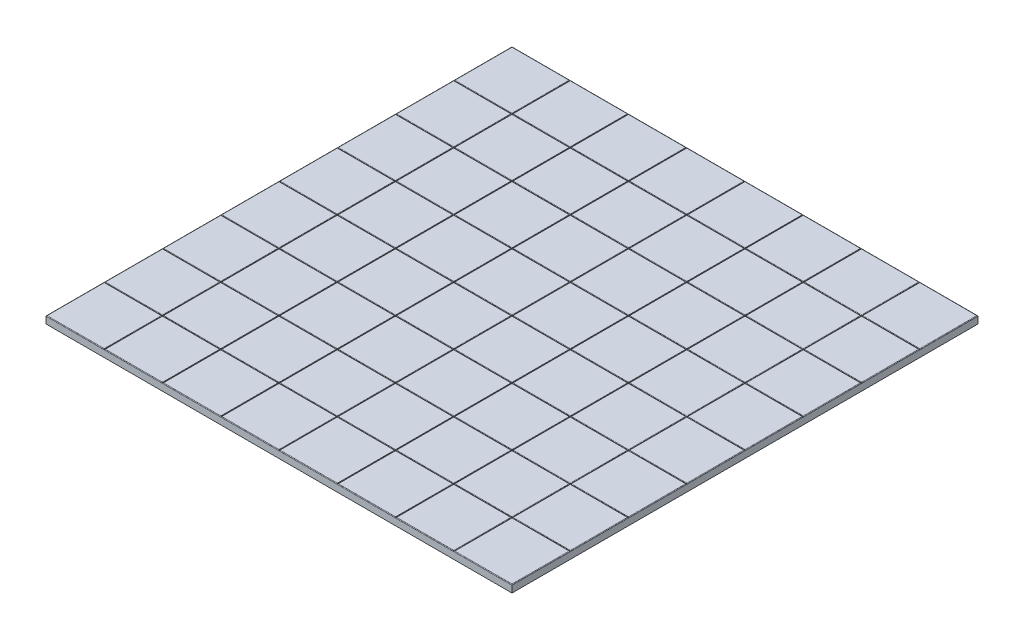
from build123d import *

# Parameters (mm, degrees)
SKETCH2_W           = 1600
SKETCH2_H           = 1600
BOSS_EXTRUDE1_DEPTH = 25
CUT_EXTRUDE1_DEPTH  = 1800
CUT_EXTRUDE5_DEPTH  = 1800
CUT_EXTRUDE6_DEPTH  = 1800
CUT_EXTRUDE9_DEPTH  = 1800
CUT_EXTRUDE10_DEPTH = 1800
CUT_EXTRUDE11_DEPTH = 1800
CUT_EXTRUDE12_DEPTH = 1800
CUT_EXTRUDE13_DEPTH = 1800


with BuildPart() as part:
    # Sketch2 → Boss-Extrude1 (new body)
    with BuildSketch(Plane(origin=(0, 0, 0), x_dir=(1, 0, 0), z_dir=(0, 1, 0))):
        with Locations((-366.131622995, 171.605086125)):
            Rectangle(SKETCH2_W, SKETCH2_H)
    extrude(amount=-BOSS_EXTRUDE1_DEPTH)

    # Sketch4 → Cut-Extrude1 (cut)
    with BuildSketch(Plane.XY.offset(750)):
        with BuildLine():
            Line((-1164.131622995, 0), (-1166.131622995, 0))
            Line((-1166.131622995, 0), (-1166.131622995, -2))
            ThreePointArc((-1166.131622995, -2), (-1165.545836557, -0.585786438), (-1164.131622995, 0))
        make_face()
    extrude(amount=-CUT_EXTRUDE1_DEPTH, mode=Mode.SUBTRACT)

    # Sketch5 → Cut-Extrude5 (cut)
    with BuildSketch(Plane.XY.offset(750)):
        with BuildLine():
            ThreePointArc((-966.24425762, -1.995387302), (-966.830044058, -0.58117374), (-968.24425762, 0.004612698))
            Line((-968.24425762, 0.004612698), (-964.24425762, 0.004612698))
            ThreePointArc((-964.24425762, 0.004612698), (-965.658471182, -0.58117374), (-966.24425762, -1.995387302))
        make_face()
        with BuildLine():
            ThreePointArc((-766.210661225, -1.966529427), (-766.796447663, -0.552315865), (-768.210661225, 0.033470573))
            Line((-768.210661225, 0.033470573), (-764.210661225, 0.033470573))
            ThreePointArc((-764.210661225, 0.033470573), (-765.624874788, -0.552315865), (-766.210661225, -1.966529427))
        make_face()
        with BuildLine():
            ThreePointArc((-566.094374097, -1.975317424), (-566.680160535, -0.561103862), (-568.094374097, 0.024682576))
            Line((-568.094374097, 0.024682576), (-564.094374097, 0.024682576))
            ThreePointArc((-564.094374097, 0.024682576), (-565.50858766, -0.561103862), (-566.094374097, -1.975317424))
        make_face()
        with BuildLine():
            ThreePointArc((-366.172549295, -1.993040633), (-366.758335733, -0.57882707), (-368.172549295, 0.006959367))
            Line((-368.172549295, 0.006959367), (-364.172549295, 0.006959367))
            ThreePointArc((-364.172549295, 0.006959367), (-365.586762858, -0.57882707), (-366.172549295, -1.993040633))
        make_face()
        with BuildLine():
            ThreePointArc((-165.984228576, -1.948557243), (-166.570015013, -0.53434368), (-167.984228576, 0.051442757))
            Line((-167.984228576, 0.051442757), (-163.984228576, 0.051442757))
            ThreePointArc((-163.984228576, 0.051442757), (-165.398442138, -0.53434368), (-165.984228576, -1.948557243))
        make_face()
        with BuildLine():
            ThreePointArc((33.91759256, -1.981036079), (33.349443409, -0.584682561), (31.967789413, 0.018333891))
            Line((31.967789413, 0.018333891), (35.867395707, 0.018333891))
            ThreePointArc((35.867395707, 0.018333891), (34.485741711, -0.584682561), (33.91759256, -1.981036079))
        make_face()
        with BuildLine():
            ThreePointArc((233.868377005, -2), (233.282590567, -0.585786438), (231.868377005, 0))
            Line((231.868377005, 0), (235.868377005, 0))
            ThreePointArc((235.868377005, 0), (234.454163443, -0.585786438), (233.868377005, -2))
        make_face()
    extrude(amount=-CUT_EXTRUDE5_DEPTH, mode=Mode.SUBTRACT)

    # Sketch8 → Cut-Extrude6 (cut)
    with BuildSketch(Plane.XY.offset(628.394913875)):
        with BuildLine():
            Line((431.868377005, 0), (433.868377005, 0))
            Line((433.868377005, 0), (433.868377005, -2))
            ThreePointArc((433.868377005, -2), (433.282590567, -0.585786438), (431.868377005, 0))
        make_face()
    extrude(amount=-CUT_EXTRUDE6_DEPTH, mode=Mode.SUBTRACT)

    # Sketch13 → Cut-Extrude9 (cut)
    with BuildSketch(Plane(origin=(550, 0, 0), x_dir=(0, 0, -1), z_dir=(1, 0, 0))):
        with BuildLine():
            Line((969.605086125, 0), (971.605086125, 0))
            Line((971.605086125, 0), (971.605086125, -2))
            ThreePointArc((971.605086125, -2), (971.019299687, -0.585786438), (969.605086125, 0))
        make_face()
        with BuildLine():
            Line((-628.394913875, 0), (-628.394913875, -2))
            ThreePointArc((-628.394913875, -2), (-627.809127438, -0.585786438), (-626.394913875, 0))
            Line((-626.394913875, 0), (-628.394913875, 0))
        make_face()
    extrude(amount=-CUT_EXTRUDE9_DEPTH, mode=Mode.SUBTRACT)

    # Sketch14 → Cut-Extrude10 (cut)
    with BuildSketch(Plane(origin=(433.868377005, 0, 0), x_dir=(0, 0, -1), z_dir=(1, 0, 0))):
        with BuildLine():
            ThreePointArc((-428.394913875, -2), (-428.980700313, -0.585786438), (-430.394913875, 0))
            Line((-430.394913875, 0), (-426.394913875, 0))
            ThreePointArc((-426.394913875, 0), (-427.809127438, -0.585786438), (-428.394913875, -2))
        make_face()
    extrude(amount=-CUT_EXTRUDE10_DEPTH, mode=Mode.SUBTRACT)

    # Sketch15 → Cut-Extrude11 (cut)
    with BuildSketch(Plane(origin=(550, 0, 0), x_dir=(0, 0, -1), z_dir=(1, 0, 0))):
        with BuildLine():
            ThreePointArc((-26.394913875, 0), (-27.809127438, -0.585786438), (-28.394913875, -2))
            ThreePointArc((-28.394913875, -2), (-28.980700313, -0.585786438), (-30.394913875, 0))
            Line((-30.394913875, 0), (-26.394913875, 0))
        make_face()
        with BuildLine():
            ThreePointArc((-226.394913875, 0), (-227.809127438, -0.585786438), (-228.394913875, -2))
            ThreePointArc((-228.394913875, -2), (-228.980700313, -0.585786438), (-230.394913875, 0))
            Line((-230.394913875, 0), (-226.394913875, 0))
        make_face()
    extrude(amount=-CUT_EXTRUDE11_DEPTH, mode=Mode.SUBTRACT)

    # Sketch16 → Cut-Extrude12 (cut)
    with BuildSketch(Plane(origin=(550, 0, 0), x_dir=(0, 0, -1), z_dir=(1, 0, 0))):
        with BuildLine():
            ThreePointArc((173.605086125, 0), (172.190872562, -0.585786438), (171.605086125, -2))
            ThreePointArc((171.605086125, -2), (171.019299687, -0.585786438), (169.605086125, 0))
            Line((169.605086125, 0), (173.605086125, 0))
        make_face()
        with BuildLine():
            ThreePointArc((373.605086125, 0), (372.190872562, -0.585786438), (371.605086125, -2))
            ThreePointArc((371.605086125, -2), (371.019299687, -0.585786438), (369.605086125, 0))
            Line((369.605086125, 0), (373.605086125, 0))
        make_face()
    extrude(amount=-CUT_EXTRUDE12_DEPTH, mode=Mode.SUBTRACT)

    # Sketch17 → Cut-Extrude13 (cut)
    with BuildSketch(Plane(origin=(550, 0, 0), x_dir=(0, 0, -1), z_dir=(1, 0, 0))):
        with BuildLine():
            Line((569.605086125, 0), (573.605086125, 0))
            ThreePointArc((573.605086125, 0), (572.190872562, -0.585786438), (571.605086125, -2))
            ThreePointArc((571.605086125, -2), (571.019299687, -0.585786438), (569.605086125, 0))
        make_face()
        with BuildLine():
            Line((769.605086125, 0), (773.605086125, 0))
            ThreePointArc((773.605086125, 0), (772.190872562, -0.585786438), (771.605086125, -2))
            ThreePointArc((771.605086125, -2), (771.019299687, -0.585786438), (769.605086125, 0))
        make_face()
    extrude(amount=-CUT_EXTRUDE13_DEPTH, mode=Mode.SUBTRACT)


solid = part.part
